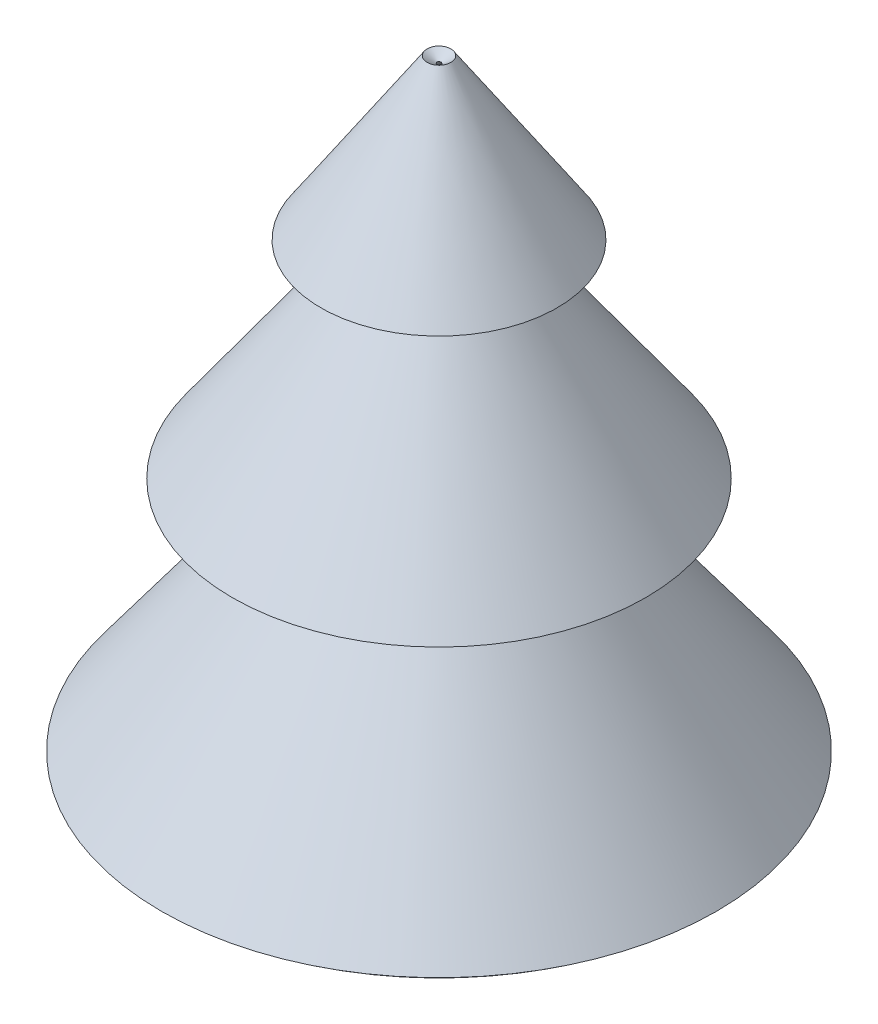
ISO-10303-21;
HEADER;
FILE_DESCRIPTION(('STEP AP214'),'2;1');
FILE_NAME('part.step','',(''),(''),'','','');
FILE_SCHEMA(('AUTOMOTIVE_DESIGN { 1 0 10303 214 1 1 1 1 }'));
ENDSEC;
DATA;
#1=APPLICATION_CONTEXT('core data for automotive mechanical design processes');
#2=APPLICATION_PROTOCOL_DEFINITION('international standard','automotive_design',2000,#1);
#3=PRODUCT_CONTEXT('',#1,'mechanical');
#4=PRODUCT('Part','Part','',(#3));
#5=PRODUCT_RELATED_PRODUCT_CATEGORY('part','',(#4));
#6=PRODUCT_DEFINITION_FORMATION('','',#4);
#7=PRODUCT_DEFINITION_CONTEXT('part definition',#1,'design');
#8=PRODUCT_DEFINITION('design','',#6,#7);
#9=PRODUCT_DEFINITION_SHAPE('','',#8);
#10=(LENGTH_UNIT() NAMED_UNIT(*) SI_UNIT(.MILLI.,.METRE.));
#11=(NAMED_UNIT(*) PLANE_ANGLE_UNIT() SI_UNIT($,.RADIAN.));
#12=(NAMED_UNIT(*) SI_UNIT($,.STERADIAN.) SOLID_ANGLE_UNIT());
#13=UNCERTAINTY_MEASURE_WITH_UNIT(LENGTH_MEASURE(1.E-05),#10,'distance_accuracy_value','');
#14=(GEOMETRIC_REPRESENTATION_CONTEXT(3) GLOBAL_UNCERTAINTY_ASSIGNED_CONTEXT((#13)) GLOBAL_UNIT_ASSIGNED_CONTEXT((#10,
#11,#12)) REPRESENTATION_CONTEXT('',''));
#15=CARTESIAN_POINT('',(0.,0.,0.));
#16=DIRECTION('',(0.,0.,1.));
#17=DIRECTION('',(1.,0.,0.));
#18=AXIS2_PLACEMENT_3D('',#15,#16,#17);
#19=CARTESIAN_POINT('',(0.,77.,0.));
#20=DIRECTION('',(0.,-1.,0.));
#21=DIRECTION('',(0.,0.,-1.));
#22=AXIS2_PLACEMENT_3D('',#19,#20,#21);
#23=CONICAL_SURFACE('',#22,16.2629658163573,0.588002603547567);
#24=CARTESIAN_POINT('',(0.,100.89059960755,0.));
#25=DIRECTION('',(0.,-1.,0.));
#26=DIRECTION('',(0.,0.,-1.));
#27=AXIS2_PLACEMENT_3D('',#24,#25,#26);
#28=CIRCLE('',#27,0.335899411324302);
#29=CARTESIAN_POINT('',(0.,100.89059960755,-0.335899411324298));
#30=VERTEX_POINT('',#29);
#31=EDGE_CURVE('E75',#30,#30,#28,.T.);
#32=CARTESIAN_POINT('',(0.,77.,0.));
#33=DIRECTION('',(0.,-1.,0.));
#34=DIRECTION('',(0.,0.,-1.));
#35=AXIS2_PLACEMENT_3D('',#32,#33,#34);
#36=CIRCLE('',#35,16.2629658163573);
#37=CARTESIAN_POINT('',(0.,77.,-16.2629658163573));
#38=VERTEX_POINT('',#37);
#39=EDGE_CURVE('E10',#38,#38,#36,.T.);
#40=CARTESIAN_POINT('',(0.,100.89059960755,-0.335899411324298));
#41=CARTESIAN_POINT('',(0.,100.641739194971,-0.501806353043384));
#42=CARTESIAN_POINT('',(0.,100.392878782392,-0.667713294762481));
#43=CARTESIAN_POINT('',(0.,99.895157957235,-0.999527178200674));
#44=CARTESIAN_POINT('',(0.,99.6462975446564,-1.16543411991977));
#45=CARTESIAN_POINT('',(0.,99.1485767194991,-1.49724800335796));
#46=CARTESIAN_POINT('',(0.,98.8997163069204,-1.66315494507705));
#47=CARTESIAN_POINT('',(0.,98.4019954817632,-1.99496882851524));
#48=CARTESIAN_POINT('',(0.,98.1531350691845,-2.16087577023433));
#49=CARTESIAN_POINT('',(0.,97.6554142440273,-2.49268965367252));
#50=CARTESIAN_POINT('',(0.,97.4065538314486,-2.65859659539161));
#51=CARTESIAN_POINT('',(0.,96.9088330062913,-2.9904104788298));
#52=CARTESIAN_POINT('',(0.,96.6599725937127,-3.1563174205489));
#53=CARTESIAN_POINT('',(0.,96.1622517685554,-3.48813130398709));
#54=CARTESIAN_POINT('',(0.,95.9133913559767,-3.65403824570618));
#55=CARTESIAN_POINT('',(0.,95.4156705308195,-3.98585212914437));
#56=CARTESIAN_POINT('',(0.,95.1668101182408,-4.15175907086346));
#57=CARTESIAN_POINT('',(0.,94.6690892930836,-4.48357295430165));
#58=CARTESIAN_POINT('',(0.,94.4202288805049,-4.64947989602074));
#59=CARTESIAN_POINT('',(0.,93.9225080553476,-4.98129377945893));
#60=CARTESIAN_POINT('',(0.,93.673647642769,-5.14720072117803));
#61=CARTESIAN_POINT('',(0.,93.1759268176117,-5.47901460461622));
#62=CARTESIAN_POINT('',(0.,92.927066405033,-5.64492154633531));
#63=CARTESIAN_POINT('',(0.,92.4293455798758,-5.9767354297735));
#64=CARTESIAN_POINT('',(0.,92.1804851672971,-6.14264237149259));
#65=CARTESIAN_POINT('',(0.,91.6827643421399,-6.47445625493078));
#66=CARTESIAN_POINT('',(0.,91.4339039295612,-6.64036319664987));
#67=CARTESIAN_POINT('',(0.,90.9361831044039,-6.97217708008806));
#68=CARTESIAN_POINT('',(0.,90.6873226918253,-7.13808402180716));
#69=CARTESIAN_POINT('',(0.,90.189601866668,-7.46989790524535));
#70=CARTESIAN_POINT('',(0.,89.9407414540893,-7.63580484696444));
#71=CARTESIAN_POINT('',(0.,89.4430206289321,-7.96761873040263));
#72=CARTESIAN_POINT('',(0.,89.1941602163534,-8.13352567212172));
#73=CARTESIAN_POINT('',(0.,88.6964393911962,-8.46533955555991));
#74=CARTESIAN_POINT('',(0.,88.4475789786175,-8.631246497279));
#75=CARTESIAN_POINT('',(0.,87.9498581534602,-8.96306038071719));
#76=CARTESIAN_POINT('',(0.,87.7009977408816,-9.12896732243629));
#77=CARTESIAN_POINT('',(0.,87.2032769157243,-9.46078120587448));
#78=CARTESIAN_POINT('',(0.,86.9544165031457,-9.62668814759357));
#79=CARTESIAN_POINT('',(0.,86.4566956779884,-9.95850203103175));
#80=CARTESIAN_POINT('',(0.,86.2078352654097,-10.1244089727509));
#81=CARTESIAN_POINT('',(0.,85.7101144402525,-10.456222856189));
#82=CARTESIAN_POINT('',(0.,85.4612540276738,-10.6221297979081));
#83=CARTESIAN_POINT('',(0.,84.9635332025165,-10.9539436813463));
#84=CARTESIAN_POINT('',(0.,84.7146727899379,-11.1198506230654));
#85=CARTESIAN_POINT('',(0.,84.2169519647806,-11.4516645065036));
#86=CARTESIAN_POINT('',(0.,83.968091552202,-11.6175714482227));
#87=CARTESIAN_POINT('',(0.,83.4703707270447,-11.9493853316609));
#88=CARTESIAN_POINT('',(0.,83.221510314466,-12.11529227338));
#89=CARTESIAN_POINT('',(0.,82.7237894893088,-12.4471061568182));
#90=CARTESIAN_POINT('',(0.,82.4749290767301,-12.6130130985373));
#91=CARTESIAN_POINT('',(0.,81.9772082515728,-12.9448269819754));
#92=CARTESIAN_POINT('',(0.,81.7283478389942,-13.1107339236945));
#93=CARTESIAN_POINT('',(0.,81.2306270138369,-13.4425478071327));
#94=CARTESIAN_POINT('',(0.,80.9817666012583,-13.6084547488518));
#95=CARTESIAN_POINT('',(0.,80.484045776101,-13.94026863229));
#96=CARTESIAN_POINT('',(0.,80.2351853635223,-14.1061755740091));
#97=CARTESIAN_POINT('',(0.,79.7374645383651,-14.4379894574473));
#98=CARTESIAN_POINT('',(0.,79.4886041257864,-14.6038963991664));
#99=CARTESIAN_POINT('',(0.,78.9908833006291,-14.9357102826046));
#100=CARTESIAN_POINT('',(0.,78.7420228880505,-15.1016172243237));
#101=CARTESIAN_POINT('',(0.,78.2443020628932,-15.4334311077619));
#102=CARTESIAN_POINT('',(0.,77.9954416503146,-15.599338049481));
#103=CARTESIAN_POINT('',(0.,77.4977208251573,-15.9311519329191));
#104=CARTESIAN_POINT('',(0.,77.2488604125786,-16.0970588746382));
#105=CARTESIAN_POINT('',(0.,77.,-16.2629658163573));
#106=B_SPLINE_CURVE_WITH_KNOTS('',3,(#40,#41,#42,#43,#44,#45,#46,#47,#48,#49,#50,#51,#52,#53,
#54,#55,#56,#57,#58,#59,#60,#61,#62,#63,#64,#65,#66,#67,#68,#69,#70,#71,#72,#73,#74,#75,#76,#77,
#78,#79,#80,#81,#82,#83,#84,#85,#86,#87,#88,#89,#90,#91,#92,#93,#94,#95,#96,#97,#98,#99,#100,
#101,#102,#103,#104,#105),.UNSPECIFIED.,.F.,.F.,(4,2,2,2,2,2,2,2,2,2,2,2,2,2,2,2,2,2,2,2,2,2,2,
2,2,2,2,2,2,2,2,2,4),(0.,0.897278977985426,1.79455795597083,2.69183693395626,3.58911591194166,
4.48639488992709,5.38367386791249,6.28095284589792,7.17823182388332,8.07551080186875,
8.97278977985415,9.87006875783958,10.767347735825,11.6646267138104,12.5619056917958,
13.4591846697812,14.3564636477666,15.2537426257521,16.1510216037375,17.0483005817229,
17.9455795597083,18.8428585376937,19.7401375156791,20.6374164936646,21.53469547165,
22.4319744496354,23.3292534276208,24.2265324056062,25.1238113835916,26.021090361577,
26.9183693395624,27.8156483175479,28.7129272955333),.UNSPECIFIED.);
#107=EDGE_CURVE('BSEAM35',#30,#38,#106,.T.);
#108=ORIENTED_EDGE('',*,*,#31,.F.);
#109=ORIENTED_EDGE('',*,*,#39,.T.);
#110=ORIENTED_EDGE('',*,*,#107,.T.);
#111=ORIENTED_EDGE('',*,*,#107,.F.);
#112=EDGE_LOOP('',(#108,#110,#109,#111));
#113=FACE_BOUND('',#112,.T.);
#114=ADVANCED_FACE('F35',(#113),#23,.F.);
#115=CARTESIAN_POINT('',(-10.,77.,0.));
#116=DIRECTION('',(0.,-1.,0.));
#117=DIRECTION('',(0.,0.,-1.));
#118=AXIS2_PLACEMENT_3D('',#115,#116,#117);
#119=PLANE('',#118);
#120=ORIENTED_EDGE('',*,*,#39,.F.);
#121=EDGE_LOOP('',(#120));
#122=FACE_BOUND('',#121,.T.);
#123=CARTESIAN_POINT('',(0.,77.,0.));
#124=DIRECTION('',(0.,-1.,0.));
#125=DIRECTION('',(0.,0.,-1.));
#126=AXIS2_PLACEMENT_3D('',#123,#124,#125);
#127=CIRCLE('',#126,6.11362135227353);
#128=CARTESIAN_POINT('',(0.,77.,-6.11362135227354));
#129=VERTEX_POINT('',#128);
#130=EDGE_CURVE('E41',#129,#129,#127,.T.);
#131=ORIENTED_EDGE('',*,*,#130,.T.);
#132=EDGE_LOOP('',(#131));
#133=FACE_BOUND('',#132,.T.);
#134=ADVANCED_FACE('F83',(#122,#133),#119,.F.);
#135=CARTESIAN_POINT('',(0.,42.,0.));
#136=DIRECTION('',(0.,-1.,0.));
#137=DIRECTION('',(0.,0.,-1.));
#138=AXIS2_PLACEMENT_3D('',#135,#136,#137);
#139=CONICAL_SURFACE('',#138,31.1136213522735,0.620249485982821);
#140=CARTESIAN_POINT('',(0.,42.,0.));
#141=DIRECTION('',(0.,-1.,0.));
#142=DIRECTION('',(0.,0.,-1.));
#143=AXIS2_PLACEMENT_3D('',#140,#141,#142);
#144=CIRCLE('',#143,31.1136213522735);
#145=CARTESIAN_POINT('',(0.,42.,-31.1136213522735));
#146=VERTEX_POINT('',#145);
#147=EDGE_CURVE('E45',#146,#146,#144,.T.);
#148=CARTESIAN_POINT('',(0.,77.,-6.11362135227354));
#149=CARTESIAN_POINT('',(0.,76.6354166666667,-6.3740380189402));
#150=CARTESIAN_POINT('',(0.,76.2708333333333,-6.63445468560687));
#151=CARTESIAN_POINT('',(0.,75.5416666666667,-7.1552880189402));
#152=CARTESIAN_POINT('',(0.,75.1770833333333,-7.41570468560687));
#153=CARTESIAN_POINT('',(0.,74.4479166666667,-7.9365380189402));
#154=CARTESIAN_POINT('',(0.,74.0833333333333,-8.19695468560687));
#155=CARTESIAN_POINT('',(0.,73.3541666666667,-8.7177880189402));
#156=CARTESIAN_POINT('',(0.,72.9895833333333,-8.97820468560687));
#157=CARTESIAN_POINT('',(0.,72.2604166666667,-9.4990380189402));
#158=CARTESIAN_POINT('',(0.,71.8958333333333,-9.75945468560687));
#159=CARTESIAN_POINT('',(0.,71.1666666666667,-10.2802880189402));
#160=CARTESIAN_POINT('',(0.,70.8020833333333,-10.5407046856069));
#161=CARTESIAN_POINT('',(0.,70.0729166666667,-11.0615380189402));
#162=CARTESIAN_POINT('',(0.,69.7083333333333,-11.3219546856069));
#163=CARTESIAN_POINT('',(0.,68.9791666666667,-11.8427880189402));
#164=CARTESIAN_POINT('',(0.,68.6145833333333,-12.1032046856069));
#165=CARTESIAN_POINT('',(0.,67.8854166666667,-12.6240380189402));
#166=CARTESIAN_POINT('',(0.,67.5208333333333,-12.8844546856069));
#167=CARTESIAN_POINT('',(0.,66.7916666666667,-13.4052880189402));
#168=CARTESIAN_POINT('',(0.,66.4270833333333,-13.6657046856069));
#169=CARTESIAN_POINT('',(0.,65.6979166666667,-14.1865380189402));
#170=CARTESIAN_POINT('',(0.,65.3333333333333,-14.4469546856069));
#171=CARTESIAN_POINT('',(0.,64.6041666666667,-14.9677880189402));
#172=CARTESIAN_POINT('',(0.,64.2395833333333,-15.2282046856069));
#173=CARTESIAN_POINT('',(0.,63.5104166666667,-15.7490380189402));
#174=CARTESIAN_POINT('',(0.,63.1458333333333,-16.0094546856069));
#175=CARTESIAN_POINT('',(0.,62.4166666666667,-16.5302880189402));
#176=CARTESIAN_POINT('',(0.,62.0520833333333,-16.7907046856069));
#177=CARTESIAN_POINT('',(0.,61.3229166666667,-17.3115380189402));
#178=CARTESIAN_POINT('',(0.,60.9583333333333,-17.5719546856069));
#179=CARTESIAN_POINT('',(0.,60.2291666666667,-18.0927880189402));
#180=CARTESIAN_POINT('',(0.,59.8645833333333,-18.3532046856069));
#181=CARTESIAN_POINT('',(0.,59.1354166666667,-18.8740380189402));
#182=CARTESIAN_POINT('',(0.,58.7708333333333,-19.1344546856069));
#183=CARTESIAN_POINT('',(0.,58.0416666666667,-19.6552880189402));
#184=CARTESIAN_POINT('',(0.,57.6770833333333,-19.9157046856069));
#185=CARTESIAN_POINT('',(0.,56.9479166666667,-20.4365380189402));
#186=CARTESIAN_POINT('',(0.,56.5833333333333,-20.6969546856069));
#187=CARTESIAN_POINT('',(0.,55.8541666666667,-21.2177880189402));
#188=CARTESIAN_POINT('',(0.,55.4895833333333,-21.4782046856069));
#189=CARTESIAN_POINT('',(0.,54.7604166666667,-21.9990380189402));
#190=CARTESIAN_POINT('',(0.,54.3958333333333,-22.2594546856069));
#191=CARTESIAN_POINT('',(0.,53.6666666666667,-22.7802880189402));
#192=CARTESIAN_POINT('',(0.,53.3020833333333,-23.0407046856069));
#193=CARTESIAN_POINT('',(0.,52.5729166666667,-23.5615380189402));
#194=CARTESIAN_POINT('',(0.,52.2083333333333,-23.8219546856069));
#195=CARTESIAN_POINT('',(0.,51.4791666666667,-24.3427880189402));
#196=CARTESIAN_POINT('',(0.,51.1145833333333,-24.6032046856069));
#197=CARTESIAN_POINT('',(0.,50.3854166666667,-25.1240380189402));
#198=CARTESIAN_POINT('',(0.,50.0208333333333,-25.3844546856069));
#199=CARTESIAN_POINT('',(0.,49.2916666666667,-25.9052880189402));
#200=CARTESIAN_POINT('',(0.,48.9270833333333,-26.1657046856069));
#201=CARTESIAN_POINT('',(0.,48.1979166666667,-26.6865380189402));
#202=CARTESIAN_POINT('',(0.,47.8333333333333,-26.9469546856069));
#203=CARTESIAN_POINT('',(0.,47.1041666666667,-27.4677880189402));
#204=CARTESIAN_POINT('',(0.,46.7395833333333,-27.7282046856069));
#205=CARTESIAN_POINT('',(0.,46.0104166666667,-28.2490380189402));
#206=CARTESIAN_POINT('',(0.,45.6458333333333,-28.5094546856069));
#207=CARTESIAN_POINT('',(0.,44.9166666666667,-29.0302880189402));
#208=CARTESIAN_POINT('',(0.,44.5520833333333,-29.2907046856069));
#209=CARTESIAN_POINT('',(0.,43.8229166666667,-29.8115380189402));
#210=CARTESIAN_POINT('',(0.,43.4583333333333,-30.0719546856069));
#211=CARTESIAN_POINT('',(0.,42.7291666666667,-30.5927880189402));
#212=CARTESIAN_POINT('',(0.,42.3645833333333,-30.8532046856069));
#213=CARTESIAN_POINT('',(0.,42.,-31.1136213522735));
#214=B_SPLINE_CURVE_WITH_KNOTS('',3,(#148,#149,#150,#151,#152,#153,#154,#155,#156,#157,#158,
#159,#160,#161,#162,#163,#164,#165,#166,#167,#168,#169,#170,#171,#172,#173,#174,#175,#176,#177,
#178,#179,#180,#181,#182,#183,#184,#185,#186,#187,#188,#189,#190,#191,#192,#193,#194,#195,#196,
#197,#198,#199,#200,#201,#202,#203,#204,#205,#206,#207,#208,#209,#210,#211,#212,#213),
.UNSPECIFIED.,.F.,.F.,(4,2,2,2,2,2,2,2,2,2,2,2,2,2,2,2,2,2,2,2,2,2,2,2,2,2,2,2,2,2,2,2,4),(0.,
1.3441133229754,2.68822664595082,4.03233996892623,5.37645329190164,6.72056661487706,
8.06467993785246,9.40879326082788,10.7529065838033,12.0970199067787,13.4411332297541,
14.7852465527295,16.1293598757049,17.4734731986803,18.8175865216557,20.1616998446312,
21.5058131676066,22.849926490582,24.1940398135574,25.5381531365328,26.8822664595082,
28.2263797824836,29.570493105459,30.9146064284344,32.2587197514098,33.6028330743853,
34.9469463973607,36.2910597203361,37.6351730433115,38.9792863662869,40.3233996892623,
41.6675130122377,43.0116263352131),.UNSPECIFIED.);
#215=EDGE_CURVE('BSEAM87',#129,#146,#214,.T.);
#216=ORIENTED_EDGE('',*,*,#130,.F.);
#217=ORIENTED_EDGE('',*,*,#147,.T.);
#218=ORIENTED_EDGE('',*,*,#215,.T.);
#219=ORIENTED_EDGE('',*,*,#215,.F.);
#220=EDGE_LOOP('',(#216,#218,#217,#219));
#221=FACE_BOUND('',#220,.T.);
#222=ADVANCED_FACE('F87',(#221),#139,.F.);
#223=CARTESIAN_POINT('',(-17.5,42.,0.));
#224=DIRECTION('',(0.,-1.,0.));
#225=DIRECTION('',(0.,0.,-1.));
#226=AXIS2_PLACEMENT_3D('',#223,#224,#225);
#227=PLANE('',#226);
#228=ORIENTED_EDGE('',*,*,#147,.F.);
#229=EDGE_LOOP('',(#228));
#230=FACE_BOUND('',#229,.T.);
#231=CARTESIAN_POINT('',(0.,42.,0.));
#232=DIRECTION('',(0.,-1.,0.));
#233=DIRECTION('',(0.,0.,-1.));
#234=AXIS2_PLACEMENT_3D('',#231,#232,#233);
#235=CIRCLE('',#234,13.5399195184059);
#236=CARTESIAN_POINT('',(0.,42.,-13.5399195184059));
#237=VERTEX_POINT('',#236);
#238=EDGE_CURVE('E49',#237,#237,#235,.T.);
#239=ORIENTED_EDGE('',*,*,#238,.T.);
#240=EDGE_LOOP('',(#239));
#241=FACE_BOUND('',#240,.T.);
#242=ADVANCED_FACE('F92',(#230,#241),#227,.F.);
#243=CARTESIAN_POINT('',(0.,-1.1870842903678,0.));
#244=DIRECTION('',(0.,-1.,0.));
#245=DIRECTION('',(0.,0.,-1.));
#246=AXIS2_PLACEMENT_3D('',#243,#244,#245);
#247=CONICAL_SURFACE('',#246,45.3903941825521,0.635452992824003);
#248=CARTESIAN_POINT('',(0.,-1.1870842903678,0.));
#249=DIRECTION('',(0.,-1.,0.));
#250=DIRECTION('',(0.,0.,-1.));
#251=AXIS2_PLACEMENT_3D('',#248,#249,#250);
#252=CIRCLE('',#251,45.3903941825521);
#253=CARTESIAN_POINT('',(0.,-1.1870842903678,-45.3903941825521));
#254=VERTEX_POINT('',#253);
#255=EDGE_CURVE('E54',#254,#254,#252,.T.);
#256=CARTESIAN_POINT('',(0.,42.,-13.5399195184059));
#257=CARTESIAN_POINT('',(0.,41.550134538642,-13.8716952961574));
#258=CARTESIAN_POINT('',(0.,41.100269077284,-14.2034710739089));
#259=CARTESIAN_POINT('',(0.,40.200538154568,-14.867022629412));
#260=CARTESIAN_POINT('',(0.,39.75067269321,-15.1987984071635));
#261=CARTESIAN_POINT('',(0.,38.850941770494,-15.8623499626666));
#262=CARTESIAN_POINT('',(0.,38.401076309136,-16.1941257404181));
#263=CARTESIAN_POINT('',(0.,37.50134538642,-16.8576772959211));
#264=CARTESIAN_POINT('',(0.,37.051479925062,-17.1894530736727));
#265=CARTESIAN_POINT('',(0.,36.151749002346,-17.8530046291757));
#266=CARTESIAN_POINT('',(0.,35.701883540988,-18.1847804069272));
#267=CARTESIAN_POINT('',(0.,34.802152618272,-18.8483319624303));
#268=CARTESIAN_POINT('',(0.,34.352287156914,-19.1801077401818));
#269=CARTESIAN_POINT('',(0.,33.452556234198,-19.8436592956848));
#270=CARTESIAN_POINT('',(0.,33.00269077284,-20.1754350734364));
#271=CARTESIAN_POINT('',(0.,32.1029598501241,-20.8389866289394));
#272=CARTESIAN_POINT('',(0.,31.653094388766,-21.1707624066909));
#273=CARTESIAN_POINT('',(0.,30.7533634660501,-21.834313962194));
#274=CARTESIAN_POINT('',(0.,30.3034980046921,-22.1660897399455));
#275=CARTESIAN_POINT('',(0.,29.4037670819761,-22.8296412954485));
#276=CARTESIAN_POINT('',(0.,28.9539016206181,-23.1614170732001));
#277=CARTESIAN_POINT('',(0.,28.0541706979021,-23.8249686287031));
#278=CARTESIAN_POINT('',(0.,27.6043052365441,-24.1567444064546));
#279=CARTESIAN_POINT('',(0.,26.7045743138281,-24.8202959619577));
#280=CARTESIAN_POINT('',(0.,26.2547088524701,-25.1520717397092));
#281=CARTESIAN_POINT('',(0.,25.3549779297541,-25.8156232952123));
#282=CARTESIAN_POINT('',(0.,24.9051124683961,-26.1473990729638));
#283=CARTESIAN_POINT('',(0.,24.0053815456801,-26.8109506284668));
#284=CARTESIAN_POINT('',(0.,23.5555160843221,-27.1427264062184));
#285=CARTESIAN_POINT('',(0.,22.6557851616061,-27.8062779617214));
#286=CARTESIAN_POINT('',(0.,22.2059197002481,-28.1380537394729));
#287=CARTESIAN_POINT('',(0.,21.3061887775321,-28.801605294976));
#288=CARTESIAN_POINT('',(0.,20.8563233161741,-29.1333810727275));
#289=CARTESIAN_POINT('',(0.,19.9565923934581,-29.7969326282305));
#290=CARTESIAN_POINT('',(0.,19.5067269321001,-30.1287084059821));
#291=CARTESIAN_POINT('',(0.,18.6069960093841,-30.7922599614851));
#292=CARTESIAN_POINT('',(0.,18.1571305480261,-31.1240357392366));
#293=CARTESIAN_POINT('',(0.,17.2573996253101,-31.7875872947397));
#294=CARTESIAN_POINT('',(0.,16.8075341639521,-32.1193630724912));
#295=CARTESIAN_POINT('',(0.,15.9078032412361,-32.7829146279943));
#296=CARTESIAN_POINT('',(0.,15.4579377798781,-33.1146904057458));
#297=CARTESIAN_POINT('',(0.,14.5582068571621,-33.7782419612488));
#298=CARTESIAN_POINT('',(0.,14.1083413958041,-34.1100177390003));
#299=CARTESIAN_POINT('',(0.,13.2086104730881,-34.7735692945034));
#300=CARTESIAN_POINT('',(0.,12.7587450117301,-35.1053450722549));
#301=CARTESIAN_POINT('',(0.,11.8590140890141,-35.768896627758));
#302=CARTESIAN_POINT('',(0.,11.4091486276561,-36.1006724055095));
#303=CARTESIAN_POINT('',(0.,10.5094177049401,-36.7642239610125));
#304=CARTESIAN_POINT('',(0.,10.0595522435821,-37.0959997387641));
#305=CARTESIAN_POINT('',(0.,9.15982132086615,-37.7595512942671));
#306=CARTESIAN_POINT('',(0.,8.70995585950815,-38.0913270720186));
#307=CARTESIAN_POINT('',(0.,7.81022493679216,-38.7548786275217));
#308=CARTESIAN_POINT('',(0.,7.36035947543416,-39.0866544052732));
#309=CARTESIAN_POINT('',(0.,6.46062855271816,-39.7502059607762));
#310=CARTESIAN_POINT('',(0.,6.01076309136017,-40.0819817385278));
#311=CARTESIAN_POINT('',(0.,5.11103216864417,-40.7455332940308));
#312=CARTESIAN_POINT('',(0.,4.66116670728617,-41.0773090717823));
#313=CARTESIAN_POINT('',(0.,3.76143578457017,-41.7408606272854));
#314=CARTESIAN_POINT('',(0.,3.31157032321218,-42.0726364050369));
#315=CARTESIAN_POINT('',(0.,2.41183940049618,-42.73618796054));
#316=CARTESIAN_POINT('',(0.,1.96197393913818,-43.0679637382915));
#317=CARTESIAN_POINT('',(0.,1.06224301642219,-43.7315152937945));
#318=CARTESIAN_POINT('',(0.,0.612377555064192,-44.063291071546));
#319=CARTESIAN_POINT('',(0.,-0.287353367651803,-44.7268426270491));
#320=CARTESIAN_POINT('',(0.,-0.737218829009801,-45.0586184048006));
#321=CARTESIAN_POINT('',(0.,-1.1870842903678,-45.3903941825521));
#322=B_SPLINE_CURVE_WITH_KNOTS('',3,(#256,#257,#258,#259,#260,#261,#262,#263,#264,#265,#266,
#267,#268,#269,#270,#271,#272,#273,#274,#275,#276,#277,#278,#279,#280,#281,#282,#283,#284,#285,
#286,#287,#288,#289,#290,#291,#292,#293,#294,#295,#296,#297,#298,#299,#300,#301,#302,#303,#304,
#305,#306,#307,#308,#309,#310,#311,#312,#313,#314,#315,#316,#317,#318,#319,#320,#321),
.UNSPECIFIED.,.F.,.F.,(4,2,2,2,2,2,2,2,2,2,2,2,2,2,2,2,2,2,2,2,2,2,2,2,2,2,2,2,2,2,2,2,4),(0.,
1.67692781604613,3.35385563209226,5.0307834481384,6.70771126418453,8.38463908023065,
10.0615668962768,11.7384947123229,13.4154225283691,15.0923503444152,16.7692781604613,
18.4462059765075,20.1231337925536,21.8000616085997,23.4769894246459,25.153917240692,
26.8308450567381,28.5077728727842,30.1847006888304,31.8616285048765,33.5385563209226,
35.2154841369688,36.8924119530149,38.569339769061,40.2462675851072,41.9231954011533,
43.6001232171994,45.2770510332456,46.9539788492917,48.6309066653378,50.307834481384,
51.9847622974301,53.6616901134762),.UNSPECIFIED.);
#323=EDGE_CURVE('BSEAM98',#237,#254,#322,.T.);
#324=ORIENTED_EDGE('',*,*,#238,.F.);
#325=ORIENTED_EDGE('',*,*,#255,.T.);
#326=ORIENTED_EDGE('',*,*,#323,.T.);
#327=ORIENTED_EDGE('',*,*,#323,.F.);
#328=EDGE_LOOP('',(#324,#326,#325,#327));
#329=FACE_BOUND('',#328,.T.);
#330=ADVANCED_FACE('F98',(#329),#247,.F.);
#331=CARTESIAN_POINT('',(0.,-1.1870842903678,0.));
#332=DIRECTION('',(0.,1.,0.));
#333=DIRECTION('',(0.,0.,1.));
#334=AXIS2_PLACEMENT_3D('',#331,#332,#333);
#335=CONICAL_SURFACE('',#334,45.3903941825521,0.935343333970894);
#336=CARTESIAN_POINT('',(0.,0.,0.));
#337=DIRECTION('',(0.,-1.,0.));
#338=DIRECTION('',(0.,0.,-1.));
#339=AXIS2_PLACEMENT_3D('',#336,#337,#338);
#340=CIRCLE('',#339,47.);
#341=CARTESIAN_POINT('',(0.,0.,-47.));
#342=VERTEX_POINT('',#341);
#343=EDGE_CURVE('E57',#342,#342,#340,.T.);
#344=ORIENTED_EDGE('',*,*,#343,.T.);
#345=EDGE_LOOP('',(#344));
#346=FACE_BOUND('',#345,.T.);
#347=ORIENTED_EDGE('',*,*,#255,.F.);
#348=EDGE_LOOP('',(#347));
#349=FACE_BOUND('',#348,.T.);
#350=ADVANCED_FACE('F102',(#346,#349),#335,.T.);
#351=CARTESIAN_POINT('',(0.,0.,0.));
#352=DIRECTION('',(0.,-1.,0.));
#353=DIRECTION('',(0.,0.,-1.));
#354=AXIS2_PLACEMENT_3D('',#351,#352,#353);
#355=CONICAL_SURFACE('',#354,47.,0.635452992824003);
#356=CARTESIAN_POINT('',(0.,40.,0.));
#357=DIRECTION('',(0.,-1.,0.));
#358=DIRECTION('',(0.,0.,-1.));
#359=AXIS2_PLACEMENT_3D('',#356,#357,#358);
#360=CIRCLE('',#359,17.5);
#361=CARTESIAN_POINT('',(0.,40.,-17.5));
#362=VERTEX_POINT('',#361);
#363=EDGE_CURVE('E60',#362,#362,#360,.T.);
#364=ORIENTED_EDGE('',*,*,#363,.T.);
#365=EDGE_LOOP('',(#364));
#366=FACE_BOUND('',#365,.T.);
#367=ORIENTED_EDGE('',*,*,#343,.F.);
#368=EDGE_LOOP('',(#367));
#369=FACE_BOUND('',#368,.T.);
#370=ADVANCED_FACE('F106',(#366,#369),#355,.T.);
#371=CARTESIAN_POINT('',(-17.5,40.,0.));
#372=DIRECTION('',(0.,-1.,0.));
#373=DIRECTION('',(0.,0.,-1.));
#374=AXIS2_PLACEMENT_3D('',#371,#372,#373);
#375=PLANE('',#374);
#376=CARTESIAN_POINT('',(0.,40.,0.));
#377=DIRECTION('',(0.,-1.,0.));
#378=DIRECTION('',(0.,0.,-1.));
#379=AXIS2_PLACEMENT_3D('',#376,#377,#378);
#380=CIRCLE('',#379,35.);
#381=CARTESIAN_POINT('',(0.,40.,-35.));
#382=VERTEX_POINT('',#381);
#383=EDGE_CURVE('E63',#382,#382,#380,.T.);
#384=ORIENTED_EDGE('',*,*,#383,.T.);
#385=EDGE_LOOP('',(#384));
#386=FACE_BOUND('',#385,.T.);
#387=ORIENTED_EDGE('',*,*,#363,.F.);
#388=EDGE_LOOP('',(#387));
#389=FACE_BOUND('',#388,.T.);
#390=ADVANCED_FACE('F110',(#386,#389),#375,.T.);
#391=CARTESIAN_POINT('',(0.,40.,0.));
#392=DIRECTION('',(0.,-1.,0.));
#393=DIRECTION('',(0.,0.,-1.));
#394=AXIS2_PLACEMENT_3D('',#391,#392,#393);
#395=CONICAL_SURFACE('',#394,35.,0.620249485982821);
#396=CARTESIAN_POINT('',(0.,75.,0.));
#397=DIRECTION('',(0.,-1.,0.));
#398=DIRECTION('',(0.,0.,-1.));
#399=AXIS2_PLACEMENT_3D('',#396,#397,#398);
#400=CIRCLE('',#399,10.);
#401=CARTESIAN_POINT('',(0.,75.,-10.));
#402=VERTEX_POINT('',#401);
#403=EDGE_CURVE('E66',#402,#402,#400,.T.);
#404=CARTESIAN_POINT('',(0.,75.,-10.));
#405=CARTESIAN_POINT('',(0.,74.6354166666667,-10.2604166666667));
#406=CARTESIAN_POINT('',(0.,74.2708333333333,-10.5208333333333));
#407=CARTESIAN_POINT('',(0.,73.5416666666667,-11.0416666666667));
#408=CARTESIAN_POINT('',(0.,73.1770833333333,-11.3020833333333));
#409=CARTESIAN_POINT('',(0.,72.4479166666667,-11.8229166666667));
#410=CARTESIAN_POINT('',(0.,72.0833333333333,-12.0833333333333));
#411=CARTESIAN_POINT('',(0.,71.3541666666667,-12.6041666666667));
#412=CARTESIAN_POINT('',(0.,70.9895833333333,-12.8645833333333));
#413=CARTESIAN_POINT('',(0.,70.2604166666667,-13.3854166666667));
#414=CARTESIAN_POINT('',(0.,69.8958333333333,-13.6458333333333));
#415=CARTESIAN_POINT('',(0.,69.1666666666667,-14.1666666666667));
#416=CARTESIAN_POINT('',(0.,68.8020833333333,-14.4270833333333));
#417=CARTESIAN_POINT('',(0.,68.0729166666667,-14.9479166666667));
#418=CARTESIAN_POINT('',(0.,67.7083333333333,-15.2083333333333));
#419=CARTESIAN_POINT('',(0.,66.9791666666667,-15.7291666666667));
#420=CARTESIAN_POINT('',(0.,66.6145833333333,-15.9895833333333));
#421=CARTESIAN_POINT('',(0.,65.8854166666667,-16.5104166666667));
#422=CARTESIAN_POINT('',(0.,65.5208333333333,-16.7708333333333));
#423=CARTESIAN_POINT('',(0.,64.7916666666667,-17.2916666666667));
#424=CARTESIAN_POINT('',(0.,64.4270833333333,-17.5520833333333));
#425=CARTESIAN_POINT('',(0.,63.6979166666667,-18.0729166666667));
#426=CARTESIAN_POINT('',(0.,63.3333333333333,-18.3333333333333));
#427=CARTESIAN_POINT('',(0.,62.6041666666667,-18.8541666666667));
#428=CARTESIAN_POINT('',(0.,62.2395833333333,-19.1145833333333));
#429=CARTESIAN_POINT('',(0.,61.5104166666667,-19.6354166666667));
#430=CARTESIAN_POINT('',(0.,61.1458333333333,-19.8958333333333));
#431=CARTESIAN_POINT('',(0.,60.4166666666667,-20.4166666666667));
#432=CARTESIAN_POINT('',(0.,60.0520833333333,-20.6770833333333));
#433=CARTESIAN_POINT('',(0.,59.3229166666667,-21.1979166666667));
#434=CARTESIAN_POINT('',(0.,58.9583333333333,-21.4583333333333));
#435=CARTESIAN_POINT('',(0.,58.2291666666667,-21.9791666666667));
#436=CARTESIAN_POINT('',(0.,57.8645833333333,-22.2395833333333));
#437=CARTESIAN_POINT('',(0.,57.1354166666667,-22.7604166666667));
#438=CARTESIAN_POINT('',(0.,56.7708333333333,-23.0208333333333));
#439=CARTESIAN_POINT('',(0.,56.0416666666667,-23.5416666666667));
#440=CARTESIAN_POINT('',(0.,55.6770833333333,-23.8020833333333));
#441=CARTESIAN_POINT('',(0.,54.9479166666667,-24.3229166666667));
#442=CARTESIAN_POINT('',(0.,54.5833333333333,-24.5833333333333));
#443=CARTESIAN_POINT('',(0.,53.8541666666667,-25.1041666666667));
#444=CARTESIAN_POINT('',(0.,53.4895833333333,-25.3645833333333));
#445=CARTESIAN_POINT('',(0.,52.7604166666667,-25.8854166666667));
#446=CARTESIAN_POINT('',(0.,52.3958333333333,-26.1458333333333));
#447=CARTESIAN_POINT('',(0.,51.6666666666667,-26.6666666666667));
#448=CARTESIAN_POINT('',(0.,51.3020833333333,-26.9270833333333));
#449=CARTESIAN_POINT('',(0.,50.5729166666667,-27.4479166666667));
#450=CARTESIAN_POINT('',(0.,50.2083333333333,-27.7083333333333));
#451=CARTESIAN_POINT('',(0.,49.4791666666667,-28.2291666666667));
#452=CARTESIAN_POINT('',(0.,49.1145833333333,-28.4895833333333));
#453=CARTESIAN_POINT('',(0.,48.3854166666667,-29.0104166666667));
#454=CARTESIAN_POINT('',(0.,48.0208333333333,-29.2708333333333));
#455=CARTESIAN_POINT('',(0.,47.2916666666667,-29.7916666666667));
#456=CARTESIAN_POINT('',(0.,46.9270833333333,-30.0520833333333));
#457=CARTESIAN_POINT('',(0.,46.1979166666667,-30.5729166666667));
#458=CARTESIAN_POINT('',(0.,45.8333333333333,-30.8333333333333));
#459=CARTESIAN_POINT('',(0.,45.1041666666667,-31.3541666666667));
#460=CARTESIAN_POINT('',(0.,44.7395833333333,-31.6145833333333));
#461=CARTESIAN_POINT('',(0.,44.0104166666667,-32.1354166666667));
#462=CARTESIAN_POINT('',(0.,43.6458333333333,-32.3958333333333));
#463=CARTESIAN_POINT('',(0.,42.9166666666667,-32.9166666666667));
#464=CARTESIAN_POINT('',(0.,42.5520833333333,-33.1770833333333));
#465=CARTESIAN_POINT('',(0.,41.8229166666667,-33.6979166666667));
#466=CARTESIAN_POINT('',(0.,41.4583333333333,-33.9583333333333));
#467=CARTESIAN_POINT('',(0.,40.7291666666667,-34.4791666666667));
#468=CARTESIAN_POINT('',(0.,40.3645833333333,-34.7395833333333));
#469=CARTESIAN_POINT('',(0.,40.,-35.));
#470=B_SPLINE_CURVE_WITH_KNOTS('',3,(#404,#405,#406,#407,#408,#409,#410,#411,#412,#413,#414,
#415,#416,#417,#418,#419,#420,#421,#422,#423,#424,#425,#426,#427,#428,#429,#430,#431,#432,#433,
#434,#435,#436,#437,#438,#439,#440,#441,#442,#443,#444,#445,#446,#447,#448,#449,#450,#451,#452,
#453,#454,#455,#456,#457,#458,#459,#460,#461,#462,#463,#464,#465,#466,#467,#468,#469),
.UNSPECIFIED.,.F.,.F.,(4,2,2,2,2,2,2,2,2,2,2,2,2,2,2,2,2,2,2,2,2,2,2,2,2,2,2,2,2,2,2,2,4),(0.,
1.3441133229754,2.68822664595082,4.03233996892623,5.37645329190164,6.72056661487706,
8.06467993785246,9.40879326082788,10.7529065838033,12.0970199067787,13.4411332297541,
14.7852465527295,16.1293598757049,17.4734731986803,18.8175865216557,20.1616998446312,
21.5058131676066,22.849926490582,24.1940398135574,25.5381531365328,26.8822664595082,
28.2263797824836,29.570493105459,30.9146064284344,32.2587197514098,33.6028330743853,
34.9469463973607,36.2910597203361,37.6351730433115,38.9792863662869,40.3233996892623,
41.6675130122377,43.0116263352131),.UNSPECIFIED.);
#471=EDGE_CURVE('BSEAM114',#402,#382,#470,.T.);
#472=ORIENTED_EDGE('',*,*,#403,.T.);
#473=ORIENTED_EDGE('',*,*,#383,.F.);
#474=ORIENTED_EDGE('',*,*,#471,.T.);
#475=ORIENTED_EDGE('',*,*,#471,.F.);
#476=EDGE_LOOP('',(#472,#474,#473,#475));
#477=FACE_BOUND('',#476,.T.);
#478=ADVANCED_FACE('F114',(#477),#395,.T.);
#479=CARTESIAN_POINT('',(-10.,75.,0.));
#480=DIRECTION('',(0.,-1.,0.));
#481=DIRECTION('',(0.,0.,-1.));
#482=AXIS2_PLACEMENT_3D('',#479,#480,#481);
#483=PLANE('',#482);
#484=CARTESIAN_POINT('',(0.,75.,0.));
#485=DIRECTION('',(0.,-1.,0.));
#486=DIRECTION('',(0.,0.,-1.));
#487=AXIS2_PLACEMENT_3D('',#484,#485,#486);
#488=CIRCLE('',#487,20.);
#489=CARTESIAN_POINT('',(0.,75.,-20.));
#490=VERTEX_POINT('',#489);
#491=EDGE_CURVE('E69',#490,#490,#488,.T.);
#492=ORIENTED_EDGE('',*,*,#491,.T.);
#493=EDGE_LOOP('',(#492));
#494=FACE_BOUND('',#493,.T.);
#495=ORIENTED_EDGE('',*,*,#403,.F.);
#496=EDGE_LOOP('',(#495));
#497=FACE_BOUND('',#496,.T.);
#498=ADVANCED_FACE('F118',(#494,#497),#483,.T.);
#499=CARTESIAN_POINT('',(0.,75.,0.));
#500=DIRECTION('',(0.,-1.,0.));
#501=DIRECTION('',(0.,0.,-1.));
#502=AXIS2_PLACEMENT_3D('',#499,#500,#501);
#503=CONICAL_SURFACE('',#502,20.,0.588002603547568);
#504=CARTESIAN_POINT('',(0.,102.,0.));
#505=DIRECTION('',(0.,-1.,0.));
#506=DIRECTION('',(0.,0.,-1.));
#507=AXIS2_PLACEMENT_3D('',#504,#505,#506);
#508=CIRCLE('',#507,1.99999999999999);
#509=CARTESIAN_POINT('',(0.,102.,-1.99999999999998));
#510=VERTEX_POINT('',#509);
#511=EDGE_CURVE('E72',#510,#510,#508,.T.);
#512=CARTESIAN_POINT('',(0.,102.,-1.99999999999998));
#513=CARTESIAN_POINT('',(0.,101.71875,-2.18749999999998));
#514=CARTESIAN_POINT('',(0.,101.4375,-2.37499999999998));
#515=CARTESIAN_POINT('',(0.,100.875,-2.74999999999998));
#516=CARTESIAN_POINT('',(0.,100.59375,-2.93749999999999));
#517=CARTESIAN_POINT('',(0.,100.03125,-3.31249999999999));
#518=CARTESIAN_POINT('',(0.,99.75,-3.49999999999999));
#519=CARTESIAN_POINT('',(0.,99.1875,-3.87499999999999));
#520=CARTESIAN_POINT('',(0.,98.90625,-4.06249999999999));
#521=CARTESIAN_POINT('',(0.,98.34375,-4.43749999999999));
#522=CARTESIAN_POINT('',(0.,98.0625,-4.62499999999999));
#523=CARTESIAN_POINT('',(0.,97.5,-4.99999999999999));
#524=CARTESIAN_POINT('',(0.,97.21875,-5.18749999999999));
#525=CARTESIAN_POINT('',(0.,96.65625,-5.56249999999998));
#526=CARTESIAN_POINT('',(0.,96.375,-5.74999999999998));
#527=CARTESIAN_POINT('',(0.,95.8125,-6.12499999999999));
#528=CARTESIAN_POINT('',(0.,95.53125,-6.31249999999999));
#529=CARTESIAN_POINT('',(0.,94.96875,-6.68749999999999));
#530=CARTESIAN_POINT('',(0.,94.6875,-6.87499999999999));
#531=CARTESIAN_POINT('',(0.,94.125,-7.24999999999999));
#532=CARTESIAN_POINT('',(0.,93.84375,-7.43749999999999));
#533=CARTESIAN_POINT('',(0.,93.28125,-7.81249999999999));
#534=CARTESIAN_POINT('',(0.,93.,-7.99999999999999));
#535=CARTESIAN_POINT('',(0.,92.4375,-8.37499999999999));
#536=CARTESIAN_POINT('',(0.,92.15625,-8.56249999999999));
#537=CARTESIAN_POINT('',(0.,91.59375,-8.93749999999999));
#538=CARTESIAN_POINT('',(0.,91.3125,-9.12499999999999));
#539=CARTESIAN_POINT('',(0.,90.75,-9.49999999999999));
#540=CARTESIAN_POINT('',(0.,90.46875,-9.68749999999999));
#541=CARTESIAN_POINT('',(0.,89.90625,-10.0625));
#542=CARTESIAN_POINT('',(0.,89.625,-10.25));
#543=CARTESIAN_POINT('',(0.,89.0625,-10.625));
#544=CARTESIAN_POINT('',(0.,88.78125,-10.8125));
#545=CARTESIAN_POINT('',(0.,88.21875,-11.1875));
#546=CARTESIAN_POINT('',(0.,87.9375,-11.375));
#547=CARTESIAN_POINT('',(0.,87.375,-11.75));
#548=CARTESIAN_POINT('',(0.,87.09375,-11.9375));
#549=CARTESIAN_POINT('',(0.,86.53125,-12.3125));
#550=CARTESIAN_POINT('',(0.,86.25,-12.5));
#551=CARTESIAN_POINT('',(0.,85.6875,-12.875));
#552=CARTESIAN_POINT('',(0.,85.40625,-13.0625));
#553=CARTESIAN_POINT('',(0.,84.84375,-13.4375));
#554=CARTESIAN_POINT('',(0.,84.5625,-13.625));
#555=CARTESIAN_POINT('',(0.,84.,-14.));
#556=CARTESIAN_POINT('',(0.,83.71875,-14.1875));
#557=CARTESIAN_POINT('',(0.,83.15625,-14.5625));
#558=CARTESIAN_POINT('',(0.,82.875,-14.75));
#559=CARTESIAN_POINT('',(0.,82.3125,-15.125));
#560=CARTESIAN_POINT('',(0.,82.03125,-15.3125));
#561=CARTESIAN_POINT('',(0.,81.46875,-15.6875));
#562=CARTESIAN_POINT('',(0.,81.1875,-15.875));
#563=CARTESIAN_POINT('',(0.,80.625,-16.25));
#564=CARTESIAN_POINT('',(0.,80.34375,-16.4375));
#565=CARTESIAN_POINT('',(0.,79.78125,-16.8125));
#566=CARTESIAN_POINT('',(0.,79.5,-17.));
#567=CARTESIAN_POINT('',(0.,78.9375,-17.375));
#568=CARTESIAN_POINT('',(0.,78.65625,-17.5625));
#569=CARTESIAN_POINT('',(0.,78.09375,-17.9375));
#570=CARTESIAN_POINT('',(0.,77.8125,-18.125));
#571=CARTESIAN_POINT('',(0.,77.25,-18.5));
#572=CARTESIAN_POINT('',(0.,76.96875,-18.6875));
#573=CARTESIAN_POINT('',(0.,76.40625,-19.0625));
#574=CARTESIAN_POINT('',(0.,76.125,-19.25));
#575=CARTESIAN_POINT('',(0.,75.5625,-19.625));
#576=CARTESIAN_POINT('',(0.,75.28125,-19.8125));
#577=CARTESIAN_POINT('',(0.,75.,-20.));
#578=B_SPLINE_CURVE_WITH_KNOTS('',3,(#512,#513,#514,#515,#516,#517,#518,#519,#520,#521,#522,
#523,#524,#525,#526,#527,#528,#529,#530,#531,#532,#533,#534,#535,#536,#537,#538,#539,#540,#541,
#542,#543,#544,#545,#546,#547,#548,#549,#550,#551,#552,#553,#554,#555,#556,#557,#558,#559,#560,
#561,#562,#563,#564,#565,#566,#567,#568,#569,#570,#571,#572,#573,#574,#575,#576,#577),
.UNSPECIFIED.,.F.,.F.,(4,2,2,2,2,2,2,2,2,2,2,2,2,2,2,2,2,2,2,2,2,2,2,2,2,2,2,2,2,2,2,2,4),(0.,
1.01406129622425,2.0281225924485,3.04218388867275,4.056245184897,5.07030648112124,
6.08436777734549,7.09842907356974,8.11249036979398,9.12655166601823,10.1406129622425,
11.1546742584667,12.168735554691,13.1827968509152,14.1968581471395,15.2109194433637,
16.224980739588,17.2390420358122,18.2531033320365,19.2671646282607,20.281225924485,
21.2952872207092,22.3093485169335,23.3234098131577,24.3374711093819,25.3515324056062,
26.3655937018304,27.3796549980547,28.3937162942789,29.4077775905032,30.4218388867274,
31.4359001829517,32.4499614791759),.UNSPECIFIED.);
#579=EDGE_CURVE('BSEAM122',#510,#490,#578,.T.);
#580=ORIENTED_EDGE('',*,*,#511,.T.);
#581=ORIENTED_EDGE('',*,*,#491,.F.);
#582=ORIENTED_EDGE('',*,*,#579,.T.);
#583=ORIENTED_EDGE('',*,*,#579,.F.);
#584=EDGE_LOOP('',(#580,#582,#581,#583));
#585=FACE_BOUND('',#584,.T.);
#586=ADVANCED_FACE('F122',(#585),#503,.T.);
#587=CARTESIAN_POINT('',(0.,102.,0.));
#588=DIRECTION('',(0.,1.,0.));
#589=DIRECTION('',(0.,0.,1.));
#590=AXIS2_PLACEMENT_3D('',#587,#588,#589);
#591=CONICAL_SURFACE('',#590,1.99999999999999,0.982793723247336);
#592=ORIENTED_EDGE('',*,*,#31,.T.);
#593=EDGE_LOOP('',(#592));
#594=FACE_BOUND('',#593,.T.);
#595=ORIENTED_EDGE('',*,*,#511,.F.);
#596=EDGE_LOOP('',(#595));
#597=FACE_BOUND('',#596,.T.);
#598=ADVANCED_FACE('F79',(#594,#597),#591,.F.);
#599=CLOSED_SHELL('',(#114,#134,#222,#242,#330,#350,#370,#390,#478,#498,#586,#598));
#600=MANIFOLD_SOLID_BREP('B2',#599);
#601=ADVANCED_BREP_SHAPE_REPRESENTATION('',(#18,#600),#14);
#602=SHAPE_DEFINITION_REPRESENTATION(#9,#601);
ENDSEC;
END-ISO-10303-21;
